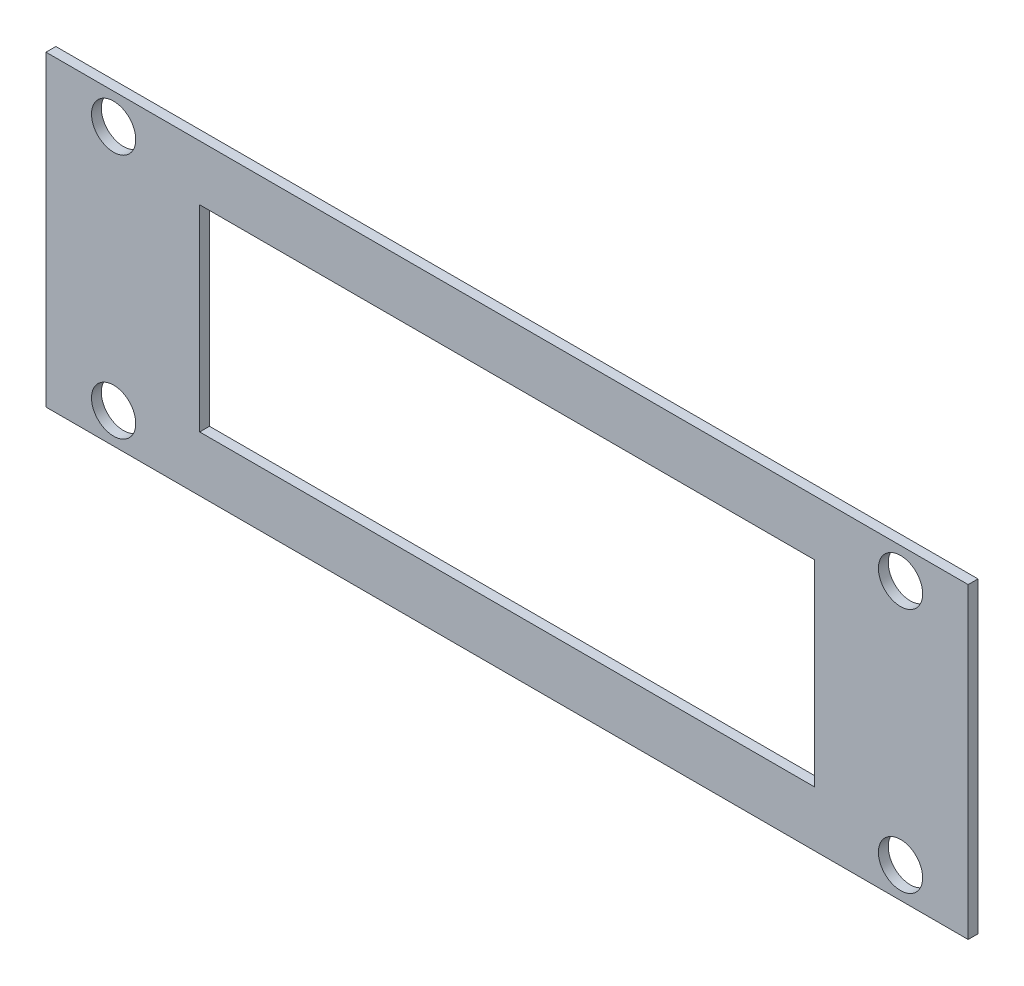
ISO-10303-21;
HEADER;
FILE_DESCRIPTION(('STEP AP214'),'2;1');
FILE_NAME('part.step','',(''),(''),'','','');
FILE_SCHEMA(('AUTOMOTIVE_DESIGN { 1 0 10303 214 1 1 1 1 }'));
ENDSEC;
DATA;
#1=APPLICATION_CONTEXT('core data for automotive mechanical design processes');
#2=APPLICATION_PROTOCOL_DEFINITION('international standard','automotive_design',2000,#1);
#3=PRODUCT_CONTEXT('',#1,'mechanical');
#4=PRODUCT('Part','Part','',(#3));
#5=PRODUCT_RELATED_PRODUCT_CATEGORY('part','',(#4));
#6=PRODUCT_DEFINITION_FORMATION('','',#4);
#7=PRODUCT_DEFINITION_CONTEXT('part definition',#1,'design');
#8=PRODUCT_DEFINITION('design','',#6,#7);
#9=PRODUCT_DEFINITION_SHAPE('','',#8);
#10=(LENGTH_UNIT() NAMED_UNIT(*) SI_UNIT(.MILLI.,.METRE.));
#11=(NAMED_UNIT(*) PLANE_ANGLE_UNIT() SI_UNIT($,.RADIAN.));
#12=(NAMED_UNIT(*) SI_UNIT($,.STERADIAN.) SOLID_ANGLE_UNIT());
#13=UNCERTAINTY_MEASURE_WITH_UNIT(LENGTH_MEASURE(1.E-05),#10,'distance_accuracy_value','');
#14=(GEOMETRIC_REPRESENTATION_CONTEXT(3) GLOBAL_UNCERTAINTY_ASSIGNED_CONTEXT((#13)) GLOBAL_UNIT_ASSIGNED_CONTEXT((#10,
#11,#12)) REPRESENTATION_CONTEXT('',''));
#15=CARTESIAN_POINT('',(0.,0.,0.));
#16=DIRECTION('',(0.,0.,1.));
#17=DIRECTION('',(1.,0.,0.));
#18=AXIS2_PLACEMENT_3D('',#15,#16,#17);
#19=CARTESIAN_POINT('',(0.,10.16,1.016));
#20=DIRECTION('',(0.,1.,0.));
#21=DIRECTION('',(0.,0.,1.));
#22=AXIS2_PLACEMENT_3D('',#19,#20,#21);
#23=PLANE('',#22);
#24=DIRECTION('',(1.,0.,0.));
#25=VECTOR('',#24,1.);
#26=CARTESIAN_POINT('',(0.,10.16,0.));
#27=LINE('',#26,#25);
#28=CARTESIAN_POINT('',(-31.75,10.16,0.));
#29=VERTEX_POINT('',#28);
#30=CARTESIAN_POINT('',(31.75,10.16,0.));
#31=VERTEX_POINT('',#30);
#32=EDGE_CURVE('E155',#29,#31,#27,.T.);
#33=ORIENTED_EDGE('',*,*,#32,.T.);
#34=DIRECTION('',(0.,0.,-1.));
#35=VECTOR('',#34,1.);
#36=CARTESIAN_POINT('',(31.75,10.16,1.016));
#37=LINE('',#36,#35);
#38=CARTESIAN_POINT('',(31.75,10.16,1.016));
#39=VERTEX_POINT('',#38);
#40=EDGE_CURVE('E11',#39,#31,#37,.T.);
#41=ORIENTED_EDGE('',*,*,#40,.F.);
#42=DIRECTION('',(1.,0.,0.));
#43=VECTOR('',#42,1.);
#44=CARTESIAN_POINT('',(0.,10.16,1.016));
#45=LINE('',#44,#43);
#46=CARTESIAN_POINT('',(-31.75,10.16,1.016));
#47=VERTEX_POINT('',#46);
#48=EDGE_CURVE('E114',#47,#39,#45,.T.);
#49=ORIENTED_EDGE('',*,*,#48,.F.);
#50=DIRECTION('',(0.,0.,-1.));
#51=VECTOR('',#50,1.);
#52=CARTESIAN_POINT('',(-31.75,10.16,1.016));
#53=LINE('',#52,#51);
#54=EDGE_CURVE('E53',#47,#29,#53,.T.);
#55=ORIENTED_EDGE('',*,*,#54,.T.);
#56=EDGE_LOOP('',(#33,#41,#49,#55));
#57=FACE_BOUND('',#56,.T.);
#58=ADVANCED_FACE('F34',(#57),#23,.F.);
#59=CARTESIAN_POINT('',(31.75,-78.2360954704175,1.016));
#60=DIRECTION('',(1.,0.,0.));
#61=DIRECTION('',(0.,0.,-1.));
#62=AXIS2_PLACEMENT_3D('',#59,#60,#61);
#63=PLANE('',#62);
#64=DIRECTION('',(0.,-1.,0.));
#65=VECTOR('',#64,1.);
#66=CARTESIAN_POINT('',(31.75,-78.2360954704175,0.));
#67=LINE('',#66,#65);
#68=CARTESIAN_POINT('',(31.75,-10.16,0.));
#69=VERTEX_POINT('',#68);
#70=EDGE_CURVE('E120',#31,#69,#67,.T.);
#71=ORIENTED_EDGE('',*,*,#70,.T.);
#72=DIRECTION('',(0.,0.,-1.));
#73=VECTOR('',#72,1.);
#74=CARTESIAN_POINT('',(31.75,-10.16,1.016));
#75=LINE('',#74,#73);
#76=CARTESIAN_POINT('',(31.75,-10.16,1.016));
#77=VERTEX_POINT('',#76);
#78=EDGE_CURVE('E44',#77,#69,#75,.T.);
#79=ORIENTED_EDGE('',*,*,#78,.F.);
#80=DIRECTION('',(0.,-1.,0.));
#81=VECTOR('',#80,1.);
#82=CARTESIAN_POINT('',(31.75,-78.2360954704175,1.016));
#83=LINE('',#82,#81);
#84=EDGE_CURVE('E107',#39,#77,#83,.T.);
#85=ORIENTED_EDGE('',*,*,#84,.F.);
#86=ORIENTED_EDGE('',*,*,#40,.T.);
#87=EDGE_LOOP('',(#71,#79,#85,#86));
#88=FACE_BOUND('',#87,.T.);
#89=ADVANCED_FACE('F119',(#88),#63,.F.);
#90=CARTESIAN_POINT('',(0.,-10.16,1.016));
#91=DIRECTION('',(0.,1.,0.));
#92=DIRECTION('',(0.,0.,1.));
#93=AXIS2_PLACEMENT_3D('',#90,#91,#92);
#94=PLANE('',#93);
#95=DIRECTION('',(1.,0.,0.));
#96=VECTOR('',#95,1.);
#97=CARTESIAN_POINT('',(0.,-10.16,0.));
#98=LINE('',#97,#96);
#99=CARTESIAN_POINT('',(-31.75,-10.16,0.));
#100=VERTEX_POINT('',#99);
#101=EDGE_CURVE('E158',#100,#69,#98,.T.);
#102=ORIENTED_EDGE('',*,*,#101,.F.);
#103=DIRECTION('',(0.,0.,-1.));
#104=VECTOR('',#103,1.);
#105=CARTESIAN_POINT('',(-31.75,-10.16,1.016));
#106=LINE('',#105,#104);
#107=CARTESIAN_POINT('',(-31.75,-10.16,1.016));
#108=VERTEX_POINT('',#107);
#109=EDGE_CURVE('E79',#108,#100,#106,.T.);
#110=ORIENTED_EDGE('',*,*,#109,.F.);
#111=DIRECTION('',(1.,0.,0.));
#112=VECTOR('',#111,1.);
#113=CARTESIAN_POINT('',(0.,-10.16,1.016));
#114=LINE('',#113,#112);
#115=EDGE_CURVE('E113',#108,#77,#114,.T.);
#116=ORIENTED_EDGE('',*,*,#115,.T.);
#117=ORIENTED_EDGE('',*,*,#78,.T.);
#118=EDGE_LOOP('',(#102,#110,#116,#117));
#119=FACE_BOUND('',#118,.T.);
#120=ADVANCED_FACE('F124',(#119),#94,.T.);
#121=CARTESIAN_POINT('',(47.6250000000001,-78.2360954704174,1.016));
#122=DIRECTION('',(1.,0.,0.));
#123=DIRECTION('',(0.,1.,0.));
#124=AXIS2_PLACEMENT_3D('',#121,#122,#123);
#125=PLANE('',#124);
#126=DIRECTION('',(0.,-1.,0.));
#127=VECTOR('',#126,1.);
#128=CARTESIAN_POINT('',(47.6250000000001,-78.2360954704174,0.));
#129=LINE('',#128,#127);
#130=CARTESIAN_POINT('',(47.625,15.875,0.));
#131=VERTEX_POINT('',#130);
#132=CARTESIAN_POINT('',(47.625,-15.875,0.));
#133=VERTEX_POINT('',#132);
#134=EDGE_CURVE('E143',#131,#133,#129,.T.);
#135=ORIENTED_EDGE('',*,*,#134,.F.);
#136=DIRECTION('',(0.,0.,-1.));
#137=VECTOR('',#136,1.);
#138=CARTESIAN_POINT('',(47.625,15.875,1.016));
#139=LINE('',#138,#137);
#140=CARTESIAN_POINT('',(47.625,15.875,1.016));
#141=VERTEX_POINT('',#140);
#142=EDGE_CURVE('E38',#141,#131,#139,.T.);
#143=ORIENTED_EDGE('',*,*,#142,.F.);
#144=DIRECTION('',(0.,-1.,0.));
#145=VECTOR('',#144,1.);
#146=CARTESIAN_POINT('',(47.6250000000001,-78.2360954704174,1.016));
#147=LINE('',#146,#145);
#148=CARTESIAN_POINT('',(47.625,-15.875,1.016));
#149=VERTEX_POINT('',#148);
#150=EDGE_CURVE('E197',#141,#149,#147,.T.);
#151=ORIENTED_EDGE('',*,*,#150,.T.);
#152=DIRECTION('',(0.,0.,-1.));
#153=VECTOR('',#152,1.);
#154=CARTESIAN_POINT('',(47.625,-15.875,1.016));
#155=LINE('',#154,#153);
#156=EDGE_CURVE('E133',#149,#133,#155,.T.);
#157=ORIENTED_EDGE('',*,*,#156,.T.);
#158=EDGE_LOOP('',(#135,#143,#151,#157));
#159=FACE_BOUND('',#158,.T.);
#160=ADVANCED_FACE('F182',(#159),#125,.T.);
#161=CARTESIAN_POINT('',(0.,15.875,1.016));
#162=DIRECTION('',(0.,1.,0.));
#163=DIRECTION('',(-1.,0.,0.));
#164=AXIS2_PLACEMENT_3D('',#161,#162,#163);
#165=PLANE('',#164);
#166=DIRECTION('',(1.,0.,0.));
#167=VECTOR('',#166,1.);
#168=CARTESIAN_POINT('',(0.,15.875,0.));
#169=LINE('',#168,#167);
#170=CARTESIAN_POINT('',(-47.625,15.875,0.));
#171=VERTEX_POINT('',#170);
#172=EDGE_CURVE('E146',#171,#131,#169,.T.);
#173=ORIENTED_EDGE('',*,*,#172,.F.);
#174=DIRECTION('',(0.,0.,-1.));
#175=VECTOR('',#174,1.);
#176=CARTESIAN_POINT('',(-47.625,15.875,1.016));
#177=LINE('',#176,#175);
#178=CARTESIAN_POINT('',(-47.625,15.875,1.016));
#179=VERTEX_POINT('',#178);
#180=EDGE_CURVE('E172',#179,#171,#177,.T.);
#181=ORIENTED_EDGE('',*,*,#180,.F.);
#182=DIRECTION('',(1.,0.,0.));
#183=VECTOR('',#182,1.);
#184=CARTESIAN_POINT('',(0.,15.875,1.016));
#185=LINE('',#184,#183);
#186=EDGE_CURVE('E181',#179,#141,#185,.T.);
#187=ORIENTED_EDGE('',*,*,#186,.T.);
#188=ORIENTED_EDGE('',*,*,#142,.T.);
#189=EDGE_LOOP('',(#173,#181,#187,#188));
#190=FACE_BOUND('',#189,.T.);
#191=ADVANCED_FACE('F179',(#190),#165,.T.);
#192=CARTESIAN_POINT('',(-47.625,-78.2360954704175,1.016));
#193=DIRECTION('',(1.,0.,0.));
#194=DIRECTION('',(0.,0.,-1.));
#195=AXIS2_PLACEMENT_3D('',#192,#193,#194);
#196=PLANE('',#195);
#197=DIRECTION('',(0.,-1.,0.));
#198=VECTOR('',#197,1.);
#199=CARTESIAN_POINT('',(-47.625,-78.2360954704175,0.));
#200=LINE('',#199,#198);
#201=CARTESIAN_POINT('',(-47.625,-15.875,0.));
#202=VERTEX_POINT('',#201);
#203=EDGE_CURVE('E149',#171,#202,#200,.T.);
#204=ORIENTED_EDGE('',*,*,#203,.T.);
#205=DIRECTION('',(0.,0.,-1.));
#206=VECTOR('',#205,1.);
#207=CARTESIAN_POINT('',(-47.625,-15.875,1.016));
#208=LINE('',#207,#206);
#209=CARTESIAN_POINT('',(-47.625,-15.875,1.016));
#210=VERTEX_POINT('',#209);
#211=EDGE_CURVE('E170',#210,#202,#208,.T.);
#212=ORIENTED_EDGE('',*,*,#211,.F.);
#213=DIRECTION('',(0.,-1.,0.));
#214=VECTOR('',#213,1.);
#215=CARTESIAN_POINT('',(-47.625,-78.2360954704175,1.016));
#216=LINE('',#215,#214);
#217=EDGE_CURVE('E190',#179,#210,#216,.T.);
#218=ORIENTED_EDGE('',*,*,#217,.F.);
#219=ORIENTED_EDGE('',*,*,#180,.T.);
#220=EDGE_LOOP('',(#204,#212,#218,#219));
#221=FACE_BOUND('',#220,.T.);
#222=ADVANCED_FACE('F188',(#221),#196,.F.);
#223=CARTESIAN_POINT('',(-31.75,-78.2360954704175,1.016));
#224=DIRECTION('',(1.,0.,0.));
#225=DIRECTION('',(0.,0.,-1.));
#226=AXIS2_PLACEMENT_3D('',#223,#224,#225);
#227=PLANE('',#226);
#228=DIRECTION('',(0.,-1.,0.));
#229=VECTOR('',#228,1.);
#230=CARTESIAN_POINT('',(-31.75,-78.2360954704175,0.));
#231=LINE('',#230,#229);
#232=EDGE_CURVE('E160',#29,#100,#231,.T.);
#233=ORIENTED_EDGE('',*,*,#232,.F.);
#234=ORIENTED_EDGE('',*,*,#54,.F.);
#235=DIRECTION('',(0.,-1.,0.));
#236=VECTOR('',#235,1.);
#237=CARTESIAN_POINT('',(-31.75,-78.2360954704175,1.016));
#238=LINE('',#237,#236);
#239=EDGE_CURVE('E125',#47,#108,#238,.T.);
#240=ORIENTED_EDGE('',*,*,#239,.T.);
#241=ORIENTED_EDGE('',*,*,#109,.T.);
#242=EDGE_LOOP('',(#233,#234,#240,#241));
#243=FACE_BOUND('',#242,.T.);
#244=ADVANCED_FACE('F244',(#243),#227,.T.);
#245=CARTESIAN_POINT('',(0.,-15.875,1.016));
#246=DIRECTION('',(0.,1.,0.));
#247=DIRECTION('',(-1.,0.,0.));
#248=AXIS2_PLACEMENT_3D('',#245,#246,#247);
#249=PLANE('',#248);
#250=DIRECTION('',(1.,0.,0.));
#251=VECTOR('',#250,1.);
#252=CARTESIAN_POINT('',(0.,-15.875,0.));
#253=LINE('',#252,#251);
#254=EDGE_CURVE('E152',#202,#133,#253,.T.);
#255=ORIENTED_EDGE('',*,*,#254,.T.);
#256=ORIENTED_EDGE('',*,*,#156,.F.);
#257=DIRECTION('',(1.,0.,0.));
#258=VECTOR('',#257,1.);
#259=CARTESIAN_POINT('',(0.,-15.875,1.016));
#260=LINE('',#259,#258);
#261=EDGE_CURVE('E193',#210,#149,#260,.T.);
#262=ORIENTED_EDGE('',*,*,#261,.F.);
#263=ORIENTED_EDGE('',*,*,#211,.T.);
#264=EDGE_LOOP('',(#255,#256,#262,#263));
#265=FACE_BOUND('',#264,.T.);
#266=ADVANCED_FACE('F192',(#265),#249,.F.);
#267=CARTESIAN_POINT('',(-40.64,12.7,1.016));
#268=DIRECTION('',(0.,0.,-1.));
#269=DIRECTION('',(-1.,0.,0.));
#270=AXIS2_PLACEMENT_3D('',#267,#268,#269);
#271=CYLINDRICAL_SURFACE('',#270,2.28599999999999);
#272=CARTESIAN_POINT('',(-40.64,12.7,1.016));
#273=DIRECTION('',(0.,0.,1.));
#274=DIRECTION('',(1.,0.,0.));
#275=AXIS2_PLACEMENT_3D('',#272,#273,#274);
#276=CIRCLE('',#275,2.28599999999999);
#277=CARTESIAN_POINT('',(-38.354,12.7,1.016));
#278=VERTEX_POINT('',#277);
#279=EDGE_CURVE('E201',#278,#278,#276,.T.);
#280=ORIENTED_EDGE('',*,*,#279,.T.);
#281=EDGE_LOOP('',(#280));
#282=FACE_BOUND('',#281,.T.);
#283=CARTESIAN_POINT('',(-40.64,12.7,0.));
#284=DIRECTION('',(0.,0.,1.));
#285=DIRECTION('',(1.,0.,0.));
#286=AXIS2_PLACEMENT_3D('',#283,#284,#285);
#287=CIRCLE('',#286,2.28599999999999);
#288=CARTESIAN_POINT('',(-38.354,12.7,0.));
#289=VERTEX_POINT('',#288);
#290=EDGE_CURVE('E140',#289,#289,#287,.T.);
#291=ORIENTED_EDGE('',*,*,#290,.F.);
#292=EDGE_LOOP('',(#291));
#293=FACE_BOUND('',#292,.T.);
#294=ADVANCED_FACE('F220',(#282,#293),#271,.F.);
#295=CARTESIAN_POINT('',(40.64,12.7,1.016));
#296=DIRECTION('',(0.,0.,-1.));
#297=DIRECTION('',(-1.,0.,0.));
#298=AXIS2_PLACEMENT_3D('',#295,#296,#297);
#299=CYLINDRICAL_SURFACE('',#298,2.28599999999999);
#300=CARTESIAN_POINT('',(40.64,12.7,1.016));
#301=DIRECTION('',(0.,0.,1.));
#302=DIRECTION('',(1.,0.,0.));
#303=AXIS2_PLACEMENT_3D('',#300,#301,#302);
#304=CIRCLE('',#303,2.28599999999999);
#305=CARTESIAN_POINT('',(42.926,12.7,1.016));
#306=VERTEX_POINT('',#305);
#307=EDGE_CURVE('E204',#306,#306,#304,.F.);
#308=ORIENTED_EDGE('',*,*,#307,.F.);
#309=EDGE_LOOP('',(#308));
#310=FACE_BOUND('',#309,.T.);
#311=CARTESIAN_POINT('',(40.64,12.7,0.));
#312=DIRECTION('',(0.,0.,1.));
#313=DIRECTION('',(1.,0.,0.));
#314=AXIS2_PLACEMENT_3D('',#311,#312,#313);
#315=CIRCLE('',#314,2.28599999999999);
#316=CARTESIAN_POINT('',(42.926,12.7,0.));
#317=VERTEX_POINT('',#316);
#318=EDGE_CURVE('E137',#317,#317,#315,.F.);
#319=ORIENTED_EDGE('',*,*,#318,.T.);
#320=EDGE_LOOP('',(#319));
#321=FACE_BOUND('',#320,.T.);
#322=ADVANCED_FACE('F223',(#310,#321),#299,.F.);
#323=CARTESIAN_POINT('',(40.64,-12.7,1.016));
#324=DIRECTION('',(0.,0.,-1.));
#325=DIRECTION('',(-1.,0.,0.));
#326=AXIS2_PLACEMENT_3D('',#323,#324,#325);
#327=CYLINDRICAL_SURFACE('',#326,2.28599999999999);
#328=CARTESIAN_POINT('',(40.64,-12.7,1.016));
#329=DIRECTION('',(0.,0.,1.));
#330=DIRECTION('',(1.,0.,0.));
#331=AXIS2_PLACEMENT_3D('',#328,#329,#330);
#332=CIRCLE('',#331,2.28599999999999);
#333=CARTESIAN_POINT('',(42.926,-12.7,1.016));
#334=VERTEX_POINT('',#333);
#335=EDGE_CURVE('E166',#334,#334,#332,.T.);
#336=ORIENTED_EDGE('',*,*,#335,.T.);
#337=EDGE_LOOP('',(#336));
#338=FACE_BOUND('',#337,.T.);
#339=CARTESIAN_POINT('',(40.64,-12.7,0.));
#340=DIRECTION('',(0.,0.,1.));
#341=DIRECTION('',(1.,0.,0.));
#342=AXIS2_PLACEMENT_3D('',#339,#340,#341);
#343=CIRCLE('',#342,2.28599999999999);
#344=CARTESIAN_POINT('',(42.926,-12.7,0.));
#345=VERTEX_POINT('',#344);
#346=EDGE_CURVE('E134',#345,#345,#343,.T.);
#347=ORIENTED_EDGE('',*,*,#346,.F.);
#348=EDGE_LOOP('',(#347));
#349=FACE_BOUND('',#348,.T.);
#350=ADVANCED_FACE('F36',(#338,#349),#327,.F.);
#351=CARTESIAN_POINT('',(-40.64,-12.7,1.016));
#352=DIRECTION('',(0.,0.,-1.));
#353=DIRECTION('',(-1.,0.,0.));
#354=AXIS2_PLACEMENT_3D('',#351,#352,#353);
#355=CYLINDRICAL_SURFACE('',#354,2.28599999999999);
#356=CARTESIAN_POINT('',(-40.64,-12.7,1.016));
#357=DIRECTION('',(0.,0.,1.));
#358=DIRECTION('',(1.,0.,0.));
#359=AXIS2_PLACEMENT_3D('',#356,#357,#358);
#360=CIRCLE('',#359,2.28599999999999);
#361=CARTESIAN_POINT('',(-38.354,-12.7,1.016));
#362=VERTEX_POINT('',#361);
#363=EDGE_CURVE('E127',#362,#362,#360,.F.);
#364=ORIENTED_EDGE('',*,*,#363,.F.);
#365=EDGE_LOOP('',(#364));
#366=FACE_BOUND('',#365,.T.);
#367=CARTESIAN_POINT('',(-40.64,-12.7,0.));
#368=DIRECTION('',(0.,0.,1.));
#369=DIRECTION('',(1.,0.,0.));
#370=AXIS2_PLACEMENT_3D('',#367,#368,#369);
#371=CIRCLE('',#370,2.28599999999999);
#372=CARTESIAN_POINT('',(-38.354,-12.7,0.));
#373=VERTEX_POINT('',#372);
#374=EDGE_CURVE('E163',#373,#373,#371,.F.);
#375=ORIENTED_EDGE('',*,*,#374,.T.);
#376=EDGE_LOOP('',(#375));
#377=FACE_BOUND('',#376,.T.);
#378=ADVANCED_FACE('F214',(#366,#377),#355,.F.);
#379=CARTESIAN_POINT('',(0.,-78.2360954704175,1.016));
#380=DIRECTION('',(0.,0.,1.));
#381=DIRECTION('',(1.,0.,0.));
#382=AXIS2_PLACEMENT_3D('',#379,#380,#381);
#383=PLANE('',#382);
#384=ORIENTED_EDGE('',*,*,#335,.F.);
#385=EDGE_LOOP('',(#384));
#386=FACE_BOUND('',#385,.T.);
#387=ORIENTED_EDGE('',*,*,#307,.T.);
#388=EDGE_LOOP('',(#387));
#389=FACE_BOUND('',#388,.T.);
#390=ORIENTED_EDGE('',*,*,#279,.F.);
#391=EDGE_LOOP('',(#390));
#392=FACE_BOUND('',#391,.T.);
#393=ORIENTED_EDGE('',*,*,#150,.F.);
#394=ORIENTED_EDGE('',*,*,#186,.F.);
#395=ORIENTED_EDGE('',*,*,#217,.T.);
#396=ORIENTED_EDGE('',*,*,#261,.T.);
#397=EDGE_LOOP('',(#393,#394,#395,#396));
#398=FACE_BOUND('',#397,.T.);
#399=ORIENTED_EDGE('',*,*,#48,.T.);
#400=ORIENTED_EDGE('',*,*,#84,.T.);
#401=ORIENTED_EDGE('',*,*,#115,.F.);
#402=ORIENTED_EDGE('',*,*,#239,.F.);
#403=EDGE_LOOP('',(#399,#400,#401,#402));
#404=FACE_BOUND('',#403,.T.);
#405=ORIENTED_EDGE('',*,*,#363,.T.);
#406=EDGE_LOOP('',(#405));
#407=FACE_BOUND('',#406,.T.);
#408=ADVANCED_FACE('F109',(#386,#389,#392,#398,#404,#407),#383,.T.);
#409=CARTESIAN_POINT('',(0.,-78.2360954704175,0.));
#410=DIRECTION('',(0.,0.,1.));
#411=DIRECTION('',(1.,0.,0.));
#412=AXIS2_PLACEMENT_3D('',#409,#410,#411);
#413=PLANE('',#412);
#414=ORIENTED_EDGE('',*,*,#346,.T.);
#415=EDGE_LOOP('',(#414));
#416=FACE_BOUND('',#415,.T.);
#417=ORIENTED_EDGE('',*,*,#318,.F.);
#418=EDGE_LOOP('',(#417));
#419=FACE_BOUND('',#418,.T.);
#420=ORIENTED_EDGE('',*,*,#290,.T.);
#421=EDGE_LOOP('',(#420));
#422=FACE_BOUND('',#421,.T.);
#423=ORIENTED_EDGE('',*,*,#134,.T.);
#424=ORIENTED_EDGE('',*,*,#254,.F.);
#425=ORIENTED_EDGE('',*,*,#203,.F.);
#426=ORIENTED_EDGE('',*,*,#172,.T.);
#427=EDGE_LOOP('',(#423,#424,#425,#426));
#428=FACE_BOUND('',#427,.T.);
#429=ORIENTED_EDGE('',*,*,#32,.F.);
#430=ORIENTED_EDGE('',*,*,#232,.T.);
#431=ORIENTED_EDGE('',*,*,#101,.T.);
#432=ORIENTED_EDGE('',*,*,#70,.F.);
#433=EDGE_LOOP('',(#429,#430,#431,#432));
#434=FACE_BOUND('',#433,.T.);
#435=ORIENTED_EDGE('',*,*,#374,.F.);
#436=EDGE_LOOP('',(#435));
#437=FACE_BOUND('',#436,.T.);
#438=ADVANCED_FACE('F185',(#416,#419,#422,#428,#434,#437),#413,.F.);
#439=CLOSED_SHELL('',(#58,#89,#120,#160,#191,#222,#244,#266,#294,#322,#350,#378,#408,#438));
#440=MANIFOLD_SOLID_BREP('B2',#439);
#441=ADVANCED_BREP_SHAPE_REPRESENTATION('',(#18,#440),#14);
#442=SHAPE_DEFINITION_REPRESENTATION(#9,#441);
ENDSEC;
END-ISO-10303-21;
